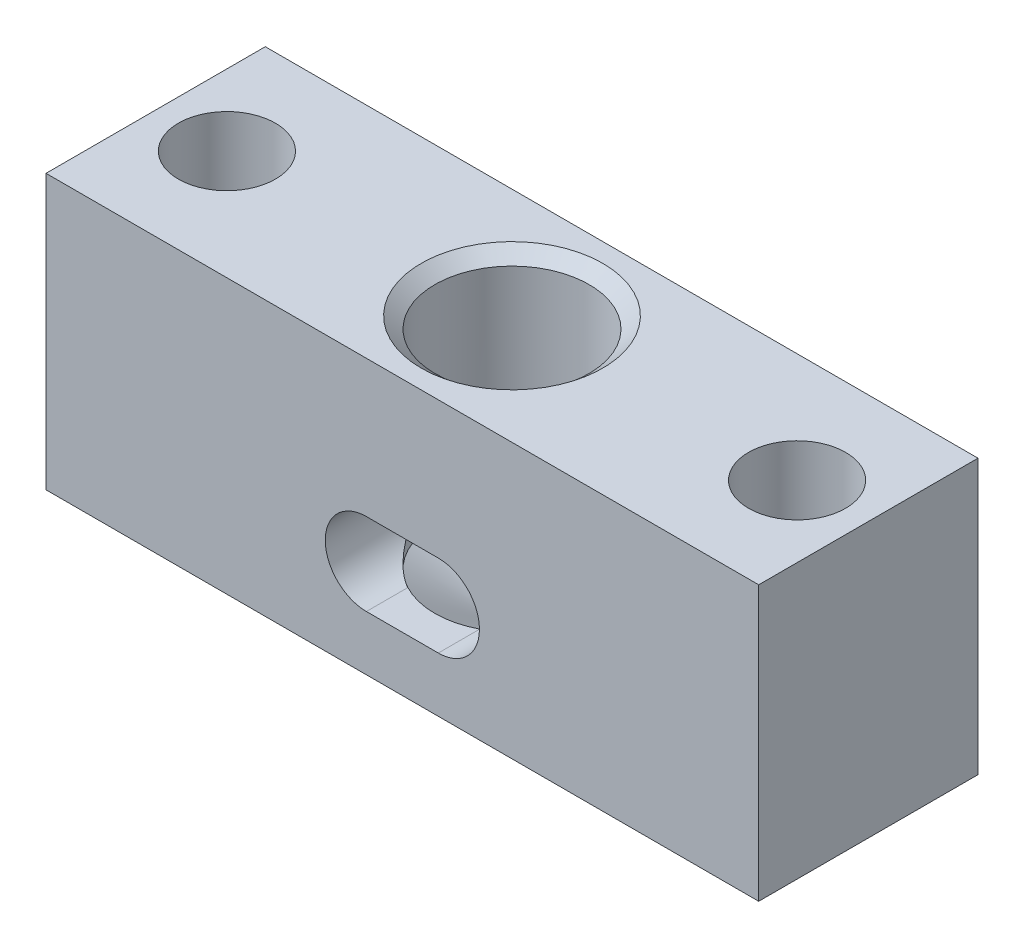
from build123d import *

# Parameters (mm, degrees)
SKETCH1_W                                 = 33.02
SKETCH1_H                                 = 12.7
BOSS_EXTRUDE1_DEPTH                       = 10.16
F_16_0_177_DIAMETER_HOLE1_D               = 4.4958
F_9_32_0_28125_DIAMETER_HOLE2_D           = 7.14375
F_9_32_0_28125_DIAMETER_HOLE2_DEPTH       = 10.16
F_9_32_0_28125_DIAMETER_HOLE2_CSINK_D     = 8.41375
F_9_32_0_28125_DIAMETER_HOLE2_CSINK_ANGLE = 100
F_9_32_0_28125_DIAMETER_HOLE2_TIP         = 2.146199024
CUT_EXTRUDE1_DEPTH                        = 38.043044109


with BuildPart() as part:
    # Sketch1 → Boss-Extrude1 (new body)
    with BuildSketch(Plane.XY):
        with Locations((-12.849206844, 13.824203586)):
            Rectangle(SKETCH1_W, SKETCH1_H)
    extrude(amount=BOSS_EXTRUDE1_DEPTH)

    # 16 _0.177_ Diameter Hole1 (through all)
    with Locations(Plane(origin=(0, 20.174203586, 0), x_dir=(1, 0, 0), z_dir=(0, 1, 0))):
        with Locations((-26.057206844, -5.08), (0.358793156, -5.08)):
            Hole(F_16_0_177_DIAMETER_HOLE1_D / 2)

    # 9_32 _0.28125_ Diameter Hole2
    with Locations(Plane(origin=(0, 20.174203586, 0), x_dir=(1, 0, 0), z_dir=(0, 1, 0))):
        with Locations((-12.849206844, -5.08)):
            CounterSinkHole(F_9_32_0_28125_DIAMETER_HOLE2_D / 2, F_9_32_0_28125_DIAMETER_HOLE2_CSINK_D / 2, depth=F_9_32_0_28125_DIAMETER_HOLE2_DEPTH, counter_sink_angle=F_9_32_0_28125_DIAMETER_HOLE2_CSINK_ANGLE)
            with Locations((0, 0, -(F_9_32_0_28125_DIAMETER_HOLE2_DEPTH + F_9_32_0_28125_DIAMETER_HOLE2_TIP / 2))):  # 118° drill point
                Cone(0, F_9_32_0_28125_DIAMETER_HOLE2_D / 2, F_9_32_0_28125_DIAMETER_HOLE2_TIP, mode=Mode.SUBTRACT)

    # Sketch8 → Cut-Extrude1 (cut, through all)
    with BuildSketch(Plane.XY.offset(10.16)):
        with BuildLine():
            Line((-14.515446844, 13.824203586), (-11.182966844, 13.824203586))
            ThreePointArc((-11.182966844, 13.824203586), (-9.277966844, 11.919203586), (-11.182966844, 10.014203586))
            Line((-11.182966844, 10.014203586), (-14.515446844, 10.014203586))
            ThreePointArc((-14.515446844, 10.014203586), (-16.420446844, 11.919203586), (-14.515446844, 13.824203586))
        make_face()
    extrude(amount=-CUT_EXTRUDE1_DEPTH, mode=Mode.SUBTRACT)


solid = part.part
